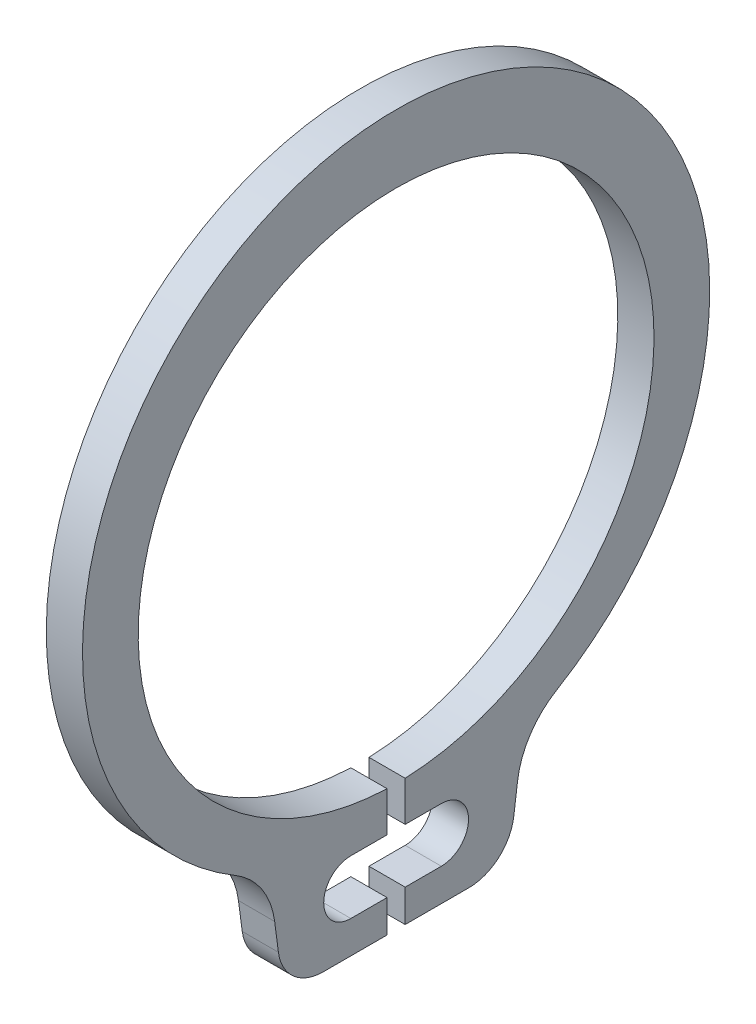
from build123d import *

# Parameters (mm, degrees)
SKETCH1_R           = 0.3
BOSS_EXTRUDE1_DEPTH = 0.2
SKETCH2_W           = 1
SKETCH2_H           = 0.6
CUT_EXTRUDE1_DEPTH  = 10


with BuildPart() as part:
    # Sketch1 → Boss-Extrude1 (new, symmetric)
    with BuildSketch(Plane(origin=(0, 0, 0), x_dir=(0, 0, -1), z_dir=(1, 0, 0))):
        with BuildLine():
            Line((-0.1, -4.248823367), (-0.1, -2.848245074))
            ThreePointArc((-0.1, -2.848245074), (0, 2.85), (0.1, -2.848245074))
            Line((0.1, -2.848245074), (0.1, -4.248823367))
            Line((0.1, -4.248823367), (0.804559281, -4.248823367))
            ThreePointArc((0.804559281, -4.248823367), (1.134232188, -4.12474327), (1.300281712, -3.814086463))
            Line((1.300281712, -3.814086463), (1.341894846, -3.498003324))
            ThreePointArc((1.341894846, -3.498003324), (1.48244939, -3.120652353), (1.773511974, -2.842386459))
            ThreePointArc((1.773511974, -2.842386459), (0, 3.6), (-1.773511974, -2.842386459))
            ThreePointArc((-1.773511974, -2.842386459), (-1.48244939, -3.120652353), (-1.341894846, -3.498003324))
            Line((-1.341894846, -3.498003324), (-1.300281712, -3.814086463))
            ThreePointArc((-1.300281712, -3.814086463), (-1.134232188, -4.12474327), (-0.804559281, -4.248823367))
            Line((-0.804559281, -4.248823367), (-0.1, -4.248823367))
        make_face()
        with Locations((0.5, -3.590351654)):
            Circle(SKETCH1_R, mode=Mode.SUBTRACT)
        with Locations((-0.5, -3.590351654)):
            Circle(SKETCH1_R, mode=Mode.SUBTRACT)
    extrude(amount=BOSS_EXTRUDE1_DEPTH, both=True)

    # Sketch2 → Cut-Extrude1 (cut)
    with BuildSketch(Plane(origin=(0.2, 0, 0), x_dir=(0, 0, -1), z_dir=(1, 0, 0))):
        with Locations((0, -3.590351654)):
            Rectangle(SKETCH2_W, SKETCH2_H)
    extrude(amount=-CUT_EXTRUDE1_DEPTH, mode=Mode.SUBTRACT)


solid = part.part
